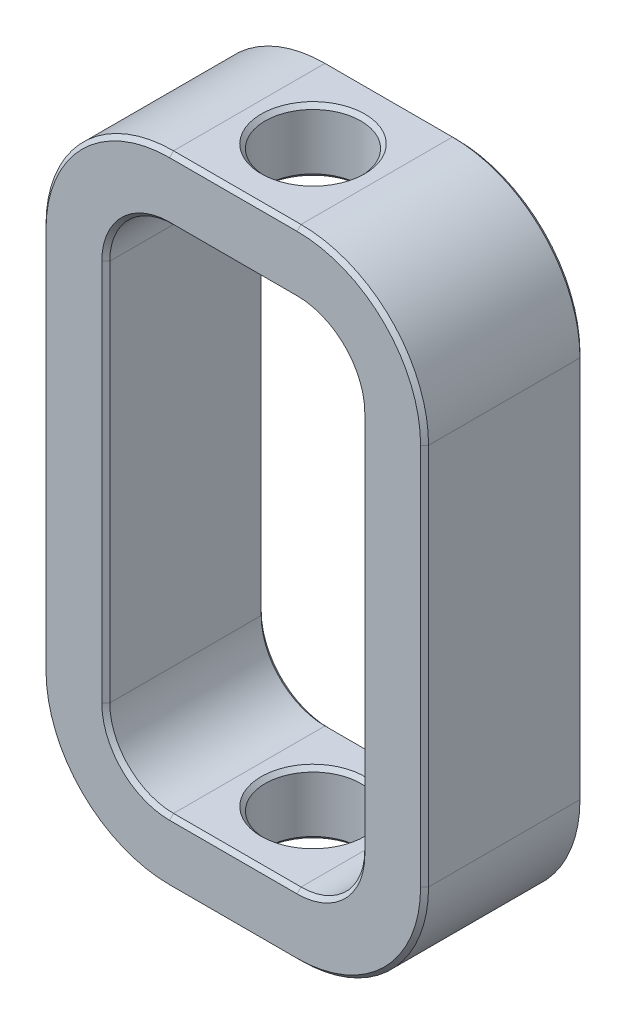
ISO-10303-21;
HEADER;
FILE_DESCRIPTION(('STEP AP214'),'2;1');
FILE_NAME('part.step','',(''),(''),'','','');
FILE_SCHEMA(('AUTOMOTIVE_DESIGN { 1 0 10303 214 1 1 1 1 }'));
ENDSEC;
DATA;
#1=APPLICATION_CONTEXT('core data for automotive mechanical design processes');
#2=APPLICATION_PROTOCOL_DEFINITION('international standard','automotive_design',2000,#1);
#3=PRODUCT_CONTEXT('',#1,'mechanical');
#4=PRODUCT('Part','Part','',(#3));
#5=PRODUCT_RELATED_PRODUCT_CATEGORY('part','',(#4));
#6=PRODUCT_DEFINITION_FORMATION('','',#4);
#7=PRODUCT_DEFINITION_CONTEXT('part definition',#1,'design');
#8=PRODUCT_DEFINITION('design','',#6,#7);
#9=PRODUCT_DEFINITION_SHAPE('','',#8);
#10=(LENGTH_UNIT() NAMED_UNIT(*) SI_UNIT(.MILLI.,.METRE.));
#11=(NAMED_UNIT(*) PLANE_ANGLE_UNIT() SI_UNIT($,.RADIAN.));
#12=(NAMED_UNIT(*) SI_UNIT($,.STERADIAN.) SOLID_ANGLE_UNIT());
#13=UNCERTAINTY_MEASURE_WITH_UNIT(LENGTH_MEASURE(1.E-05),#10,'distance_accuracy_value','');
#14=(GEOMETRIC_REPRESENTATION_CONTEXT(3) GLOBAL_UNCERTAINTY_ASSIGNED_CONTEXT((#13)) GLOBAL_UNIT_ASSIGNED_CONTEXT((#10,
#11,#12)) REPRESENTATION_CONTEXT('',''));
#15=CARTESIAN_POINT('',(0.,0.,0.));
#16=DIRECTION('',(0.,0.,1.));
#17=DIRECTION('',(1.,0.,0.));
#18=AXIS2_PLACEMENT_3D('',#15,#16,#17);
#19=CARTESIAN_POINT('',(-4.,-12.,10.));
#20=DIRECTION('',(0.,0.,-1.));
#21=DIRECTION('',(-1.,0.,0.));
#22=AXIS2_PLACEMENT_3D('',#19,#20,#21);
#23=PLANE('',#22);
#24=CARTESIAN_POINT('',(-4.,-12.,10.));
#25=DIRECTION('',(0.,0.,-1.));
#26=DIRECTION('',(-1.,0.,0.));
#27=AXIS2_PLACEMENT_3D('',#24,#25,#26);
#28=CIRCLE('',#27,4.25000000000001);
#29=CARTESIAN_POINT('',(-3.99999999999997,-16.25,10.));
#30=VERTEX_POINT('',#29);
#31=CARTESIAN_POINT('',(-8.25000000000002,-11.9999999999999,10.));
#32=VERTEX_POINT('',#31);
#33=EDGE_CURVE('E39',#30,#32,#28,.T.);
#34=ORIENTED_EDGE('',*,*,#33,.T.);
#35=DIRECTION('',(0.,1.,0.));
#36=VECTOR('',#35,1.);
#37=CARTESIAN_POINT('',(-8.25000000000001,12.,10.));
#38=LINE('',#37,#36);
#39=CARTESIAN_POINT('',(-8.25000000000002,12.,10.));
#40=VERTEX_POINT('',#39);
#41=EDGE_CURVE('E11',#32,#40,#38,.T.);
#42=ORIENTED_EDGE('',*,*,#41,.T.);
#43=CARTESIAN_POINT('',(-4.,12.,10.));
#44=DIRECTION('',(0.,0.,-1.));
#45=DIRECTION('',(-1.,0.,0.));
#46=AXIS2_PLACEMENT_3D('',#43,#44,#45);
#47=CIRCLE('',#46,4.25000000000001);
#48=CARTESIAN_POINT('',(-3.99999999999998,16.25,10.));
#49=VERTEX_POINT('',#48);
#50=EDGE_CURVE('E395',#40,#49,#47,.T.);
#51=ORIENTED_EDGE('',*,*,#50,.T.);
#52=DIRECTION('',(1.,0.,0.));
#53=VECTOR('',#52,1.);
#54=CARTESIAN_POINT('',(3.99999999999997,16.25,10.));
#55=LINE('',#54,#53);
#56=CARTESIAN_POINT('',(3.99999999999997,16.25,10.));
#57=VERTEX_POINT('',#56);
#58=EDGE_CURVE('E397',#49,#57,#55,.T.);
#59=ORIENTED_EDGE('',*,*,#58,.T.);
#60=CARTESIAN_POINT('',(4.,12.,10.));
#61=DIRECTION('',(0.,0.,-1.));
#62=DIRECTION('',(-1.,0.,0.));
#63=AXIS2_PLACEMENT_3D('',#60,#61,#62);
#64=CIRCLE('',#63,4.25000000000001);
#65=CARTESIAN_POINT('',(8.25000000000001,12.,10.));
#66=VERTEX_POINT('',#65);
#67=EDGE_CURVE('E399',#57,#66,#64,.T.);
#68=ORIENTED_EDGE('',*,*,#67,.T.);
#69=DIRECTION('',(0.,-1.,0.));
#70=VECTOR('',#69,1.);
#71=CARTESIAN_POINT('',(8.25000000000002,-12.,10.));
#72=LINE('',#71,#70);
#73=CARTESIAN_POINT('',(8.25000000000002,-12.,10.));
#74=VERTEX_POINT('',#73);
#75=EDGE_CURVE('E401',#66,#74,#72,.T.);
#76=ORIENTED_EDGE('',*,*,#75,.T.);
#77=CARTESIAN_POINT('',(4.,-12.,10.));
#78=DIRECTION('',(0.,0.,-1.));
#79=DIRECTION('',(-1.,0.,0.));
#80=AXIS2_PLACEMENT_3D('',#77,#78,#79);
#81=CIRCLE('',#80,4.25000000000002);
#82=CARTESIAN_POINT('',(3.99999999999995,-16.25,10.));
#83=VERTEX_POINT('',#82);
#84=EDGE_CURVE('E403',#74,#83,#81,.T.);
#85=ORIENTED_EDGE('',*,*,#84,.T.);
#86=DIRECTION('',(-1.,0.,0.));
#87=VECTOR('',#86,1.);
#88=CARTESIAN_POINT('',(-3.99999999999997,-16.25,10.));
#89=LINE('',#88,#87);
#90=EDGE_CURVE('E50',#83,#30,#89,.T.);
#91=ORIENTED_EDGE('',*,*,#90,.T.);
#92=EDGE_LOOP('',(#34,#42,#51,#59,#68,#76,#85,#91));
#93=FACE_BOUND('',#92,.T.);
#94=CARTESIAN_POINT('',(-4.,12.,10.));
#95=DIRECTION('',(0.,0.,-1.));
#96=DIRECTION('',(-1.,0.,0.));
#97=AXIS2_PLACEMENT_3D('',#94,#95,#96);
#98=CIRCLE('',#97,7.75000000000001);
#99=CARTESIAN_POINT('',(-3.99999999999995,19.75,10.));
#100=VERTEX_POINT('',#99);
#101=CARTESIAN_POINT('',(-11.75,12.,10.));
#102=VERTEX_POINT('',#101);
#103=EDGE_CURVE('E390',#100,#102,#98,.F.);
#104=ORIENTED_EDGE('',*,*,#103,.T.);
#105=DIRECTION('',(0.,-1.,0.));
#106=VECTOR('',#105,1.);
#107=CARTESIAN_POINT('',(-11.75,-12.,10.));
#108=LINE('',#107,#106);
#109=CARTESIAN_POINT('',(-11.75,-11.9999999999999,10.));
#110=VERTEX_POINT('',#109);
#111=EDGE_CURVE('E392',#102,#110,#108,.T.);
#112=ORIENTED_EDGE('',*,*,#111,.T.);
#113=CARTESIAN_POINT('',(-4.,-12.,10.));
#114=DIRECTION('',(0.,0.,-1.));
#115=DIRECTION('',(-1.,0.,0.));
#116=AXIS2_PLACEMENT_3D('',#113,#114,#115);
#117=CIRCLE('',#116,7.75000000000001);
#118=CARTESIAN_POINT('',(-3.99999999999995,-19.75,10.));
#119=VERTEX_POINT('',#118);
#120=EDGE_CURVE('E378',#110,#119,#117,.F.);
#121=ORIENTED_EDGE('',*,*,#120,.T.);
#122=DIRECTION('',(1.,0.,0.));
#123=VECTOR('',#122,1.);
#124=CARTESIAN_POINT('',(-4.,-19.75,10.));
#125=LINE('',#124,#123);
#126=CARTESIAN_POINT('',(3.99999999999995,-19.75,10.));
#127=VERTEX_POINT('',#126);
#128=EDGE_CURVE('E380',#119,#127,#125,.T.);
#129=ORIENTED_EDGE('',*,*,#128,.T.);
#130=CARTESIAN_POINT('',(4.,-12.,10.));
#131=DIRECTION('',(0.,0.,-1.));
#132=DIRECTION('',(-1.,0.,0.));
#133=AXIS2_PLACEMENT_3D('',#130,#131,#132);
#134=CIRCLE('',#133,7.75000000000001);
#135=CARTESIAN_POINT('',(11.75,-11.9999999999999,10.));
#136=VERTEX_POINT('',#135);
#137=EDGE_CURVE('E382',#127,#136,#134,.F.);
#138=ORIENTED_EDGE('',*,*,#137,.T.);
#139=DIRECTION('',(0.,1.,0.));
#140=VECTOR('',#139,1.);
#141=CARTESIAN_POINT('',(11.75,-12.,10.));
#142=LINE('',#141,#140);
#143=CARTESIAN_POINT('',(11.75,12.,10.));
#144=VERTEX_POINT('',#143);
#145=EDGE_CURVE('E384',#136,#144,#142,.T.);
#146=ORIENTED_EDGE('',*,*,#145,.T.);
#147=CARTESIAN_POINT('',(4.,12.,10.));
#148=DIRECTION('',(0.,0.,-1.));
#149=DIRECTION('',(-1.,0.,0.));
#150=AXIS2_PLACEMENT_3D('',#147,#148,#149);
#151=CIRCLE('',#150,7.75000000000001);
#152=CARTESIAN_POINT('',(3.99999999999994,19.75,10.));
#153=VERTEX_POINT('',#152);
#154=EDGE_CURVE('E386',#144,#153,#151,.F.);
#155=ORIENTED_EDGE('',*,*,#154,.T.);
#156=DIRECTION('',(-1.,0.,0.));
#157=VECTOR('',#156,1.);
#158=CARTESIAN_POINT('',(-4.,19.75,10.));
#159=LINE('',#158,#157);
#160=EDGE_CURVE('E388',#153,#100,#159,.T.);
#161=ORIENTED_EDGE('',*,*,#160,.T.);
#162=EDGE_LOOP('',(#104,#112,#121,#129,#138,#146,#155,#161));
#163=FACE_BOUND('',#162,.T.);
#164=ADVANCED_FACE('F30',(#93,#163),#23,.F.);
#165=CARTESIAN_POINT('',(-4.,-12.,0.));
#166=DIRECTION('',(0.,0.,-1.));
#167=DIRECTION('',(-1.,0.,0.));
#168=AXIS2_PLACEMENT_3D('',#165,#166,#167);
#169=PLANE('',#168);
#170=DIRECTION('',(0.,1.,0.));
#171=VECTOR('',#170,1.);
#172=CARTESIAN_POINT('',(8.25,-12.,0.));
#173=LINE('',#172,#171);
#174=CARTESIAN_POINT('',(8.25000000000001,-12.,0.));
#175=VERTEX_POINT('',#174);
#176=CARTESIAN_POINT('',(8.25,12.,0.));
#177=VERTEX_POINT('',#176);
#178=EDGE_CURVE('E283',#175,#177,#173,.T.);
#179=ORIENTED_EDGE('',*,*,#178,.T.);
#180=CARTESIAN_POINT('',(4.,12.,0.));
#181=DIRECTION('',(0.,0.,-1.));
#182=DIRECTION('',(-1.,0.,0.));
#183=AXIS2_PLACEMENT_3D('',#180,#181,#182);
#184=CIRCLE('',#183,4.25);
#185=CARTESIAN_POINT('',(3.99999999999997,16.25,0.));
#186=VERTEX_POINT('',#185);
#187=EDGE_CURVE('E285',#177,#186,#184,.F.);
#188=ORIENTED_EDGE('',*,*,#187,.T.);
#189=DIRECTION('',(-1.,0.,0.));
#190=VECTOR('',#189,1.);
#191=CARTESIAN_POINT('',(-4.,16.25,0.));
#192=LINE('',#191,#190);
#193=CARTESIAN_POINT('',(-3.99999999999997,16.25,0.));
#194=VERTEX_POINT('',#193);
#195=EDGE_CURVE('E266',#186,#194,#192,.T.);
#196=ORIENTED_EDGE('',*,*,#195,.T.);
#197=CARTESIAN_POINT('',(-4.,12.,0.));
#198=DIRECTION('',(0.,0.,-1.));
#199=DIRECTION('',(-1.,0.,0.));
#200=AXIS2_PLACEMENT_3D('',#197,#198,#199);
#201=CIRCLE('',#200,4.25);
#202=CARTESIAN_POINT('',(-8.25,12.,0.));
#203=VERTEX_POINT('',#202);
#204=EDGE_CURVE('E268',#194,#203,#201,.F.);
#205=ORIENTED_EDGE('',*,*,#204,.T.);
#206=DIRECTION('',(0.,-1.,0.));
#207=VECTOR('',#206,1.);
#208=CARTESIAN_POINT('',(-8.25,-12.,0.));
#209=LINE('',#208,#207);
#210=CARTESIAN_POINT('',(-8.25,-11.9999999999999,0.));
#211=VERTEX_POINT('',#210);
#212=EDGE_CURVE('E275',#203,#211,#209,.T.);
#213=ORIENTED_EDGE('',*,*,#212,.T.);
#214=CARTESIAN_POINT('',(-4.,-12.,0.));
#215=DIRECTION('',(0.,0.,-1.));
#216=DIRECTION('',(-1.,0.,0.));
#217=AXIS2_PLACEMENT_3D('',#214,#215,#216);
#218=CIRCLE('',#217,4.25);
#219=CARTESIAN_POINT('',(-3.99999999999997,-16.25,0.));
#220=VERTEX_POINT('',#219);
#221=EDGE_CURVE('E277',#211,#220,#218,.F.);
#222=ORIENTED_EDGE('',*,*,#221,.T.);
#223=DIRECTION('',(1.,0.,0.));
#224=VECTOR('',#223,1.);
#225=CARTESIAN_POINT('',(-4.,-16.25,0.));
#226=LINE('',#225,#224);
#227=CARTESIAN_POINT('',(3.99999999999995,-16.25,0.));
#228=VERTEX_POINT('',#227);
#229=EDGE_CURVE('E279',#220,#228,#226,.T.);
#230=ORIENTED_EDGE('',*,*,#229,.T.);
#231=CARTESIAN_POINT('',(4.,-12.,0.));
#232=DIRECTION('',(0.,0.,-1.));
#233=DIRECTION('',(-1.,0.,0.));
#234=AXIS2_PLACEMENT_3D('',#231,#232,#233);
#235=CIRCLE('',#234,4.25);
#236=EDGE_CURVE('E281',#228,#175,#235,.F.);
#237=ORIENTED_EDGE('',*,*,#236,.T.);
#238=EDGE_LOOP('',(#179,#188,#196,#205,#213,#222,#230,#237));
#239=FACE_BOUND('',#238,.T.);
#240=CARTESIAN_POINT('',(4.,-12.,0.));
#241=DIRECTION('',(0.,0.,-1.));
#242=DIRECTION('',(-1.,0.,0.));
#243=AXIS2_PLACEMENT_3D('',#240,#241,#242);
#244=CIRCLE('',#243,7.75000000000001);
#245=CARTESIAN_POINT('',(11.75,-11.9999999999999,0.));
#246=VERTEX_POINT('',#245);
#247=CARTESIAN_POINT('',(3.99999999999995,-19.75,0.));
#248=VERTEX_POINT('',#247);
#249=EDGE_CURVE('E265',#246,#248,#244,.T.);
#250=ORIENTED_EDGE('',*,*,#249,.T.);
#251=DIRECTION('',(-1.,0.,0.));
#252=VECTOR('',#251,1.);
#253=CARTESIAN_POINT('',(-3.99999999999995,-19.75,0.));
#254=LINE('',#253,#252);
#255=CARTESIAN_POINT('',(-3.99999999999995,-19.75,0.));
#256=VERTEX_POINT('',#255);
#257=EDGE_CURVE('E244',#248,#256,#254,.T.);
#258=ORIENTED_EDGE('',*,*,#257,.T.);
#259=CARTESIAN_POINT('',(-4.,-12.,0.));
#260=DIRECTION('',(0.,0.,-1.));
#261=DIRECTION('',(-1.,0.,0.));
#262=AXIS2_PLACEMENT_3D('',#259,#260,#261);
#263=CIRCLE('',#262,7.75000000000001);
#264=CARTESIAN_POINT('',(-11.75,-11.9999999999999,0.));
#265=VERTEX_POINT('',#264);
#266=EDGE_CURVE('E254',#256,#265,#263,.T.);
#267=ORIENTED_EDGE('',*,*,#266,.T.);
#268=DIRECTION('',(0.,1.,0.));
#269=VECTOR('',#268,1.);
#270=CARTESIAN_POINT('',(-11.75,12.,0.));
#271=LINE('',#270,#269);
#272=CARTESIAN_POINT('',(-11.75,12.,0.));
#273=VERTEX_POINT('',#272);
#274=EDGE_CURVE('E260',#265,#273,#271,.T.);
#275=ORIENTED_EDGE('',*,*,#274,.T.);
#276=CARTESIAN_POINT('',(-4.,12.,0.));
#277=DIRECTION('',(0.,0.,-1.));
#278=DIRECTION('',(-1.,0.,0.));
#279=AXIS2_PLACEMENT_3D('',#276,#277,#278);
#280=CIRCLE('',#279,7.75000000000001);
#281=CARTESIAN_POINT('',(-3.99999999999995,19.75,0.));
#282=VERTEX_POINT('',#281);
#283=EDGE_CURVE('E523',#273,#282,#280,.T.);
#284=ORIENTED_EDGE('',*,*,#283,.T.);
#285=DIRECTION('',(1.,0.,0.));
#286=VECTOR('',#285,1.);
#287=CARTESIAN_POINT('',(3.99999999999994,19.75,0.));
#288=LINE('',#287,#286);
#289=CARTESIAN_POINT('',(3.99999999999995,19.75,0.));
#290=VERTEX_POINT('',#289);
#291=EDGE_CURVE('E525',#282,#290,#288,.T.);
#292=ORIENTED_EDGE('',*,*,#291,.T.);
#293=CARTESIAN_POINT('',(4.,12.,0.));
#294=DIRECTION('',(0.,0.,-1.));
#295=DIRECTION('',(-1.,0.,0.));
#296=AXIS2_PLACEMENT_3D('',#293,#294,#295);
#297=CIRCLE('',#296,7.75000000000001);
#298=CARTESIAN_POINT('',(11.75,12.,0.));
#299=VERTEX_POINT('',#298);
#300=EDGE_CURVE('E527',#290,#299,#297,.T.);
#301=ORIENTED_EDGE('',*,*,#300,.T.);
#302=DIRECTION('',(0.,-1.,0.));
#303=VECTOR('',#302,1.);
#304=CARTESIAN_POINT('',(11.75,-11.9999999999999,0.));
#305=LINE('',#304,#303);
#306=EDGE_CURVE('E270',#299,#246,#305,.T.);
#307=ORIENTED_EDGE('',*,*,#306,.T.);
#308=EDGE_LOOP('',(#250,#258,#267,#275,#284,#292,#301,#307));
#309=FACE_BOUND('',#308,.T.);
#310=ADVANCED_FACE('F263',(#239,#309),#169,.T.);
#311=CARTESIAN_POINT('',(-4.,-12.,10.));
#312=DIRECTION('',(0.,0.,-1.));
#313=DIRECTION('',(-1.,0.,0.));
#314=AXIS2_PLACEMENT_3D('',#311,#312,#313);
#315=CYLINDRICAL_SURFACE('',#314,8.);
#316=DIRECTION('',(0.,0.,-1.));
#317=VECTOR('',#316,1.);
#318=CARTESIAN_POINT('',(-12.,-11.9999999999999,10.));
#319=LINE('',#318,#317);
#320=CARTESIAN_POINT('',(-12.,-11.9999999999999,9.75000000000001));
#321=VERTEX_POINT('',#320);
#322=CARTESIAN_POINT('',(-12.,-11.9999999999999,0.249999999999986));
#323=VERTEX_POINT('',#322);
#324=EDGE_CURVE('E566',#321,#323,#319,.T.);
#325=ORIENTED_EDGE('',*,*,#324,.T.);
#326=CARTESIAN_POINT('',(-4.,-12.,0.249999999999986));
#327=DIRECTION('',(0.,0.,-1.));
#328=DIRECTION('',(-1.,0.,0.));
#329=AXIS2_PLACEMENT_3D('',#326,#327,#328);
#330=CIRCLE('',#329,8.);
#331=CARTESIAN_POINT('',(-3.99999999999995,-20.,0.249999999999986));
#332=VERTEX_POINT('',#331);
#333=EDGE_CURVE('E364',#323,#332,#330,.F.);
#334=ORIENTED_EDGE('',*,*,#333,.T.);
#335=DIRECTION('',(0.,0.,-1.));
#336=VECTOR('',#335,1.);
#337=CARTESIAN_POINT('',(-3.99999999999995,-20.,10.));
#338=LINE('',#337,#336);
#339=CARTESIAN_POINT('',(-3.99999999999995,-20.,9.75000000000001));
#340=VERTEX_POINT('',#339);
#341=EDGE_CURVE('E261',#340,#332,#338,.T.);
#342=ORIENTED_EDGE('',*,*,#341,.F.);
#343=CARTESIAN_POINT('',(-4.,-12.,9.75000000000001));
#344=DIRECTION('',(0.,0.,-1.));
#345=DIRECTION('',(-1.,0.,0.));
#346=AXIS2_PLACEMENT_3D('',#343,#344,#345);
#347=CIRCLE('',#346,8.);
#348=EDGE_CURVE('E362',#340,#321,#347,.T.);
#349=ORIENTED_EDGE('',*,*,#348,.T.);
#350=EDGE_LOOP('',(#325,#334,#342,#349));
#351=FACE_BOUND('',#350,.T.);
#352=ADVANCED_FACE('F544',(#351),#315,.T.);
#353=CARTESIAN_POINT('',(3.99999999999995,-20.,10.));
#354=DIRECTION('',(0.,1.,0.));
#355=DIRECTION('',(0.,0.,1.));
#356=AXIS2_PLACEMENT_3D('',#353,#354,#355);
#357=PLANE('',#356);
#358=CARTESIAN_POINT('',(0.,-20.,5.));
#359=DIRECTION('',(0.,1.,0.));
#360=DIRECTION('',(0.,0.,1.));
#361=AXIS2_PLACEMENT_3D('',#358,#359,#360);
#362=CIRCLE('',#361,3.25000000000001);
#363=CARTESIAN_POINT('',(0.,-20.,8.25000000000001));
#364=VERTEX_POINT('',#363);
#365=EDGE_CURVE('E330',#364,#364,#362,.T.);
#366=ORIENTED_EDGE('',*,*,#365,.T.);
#367=EDGE_LOOP('',(#366));
#368=FACE_BOUND('',#367,.T.);
#369=ORIENTED_EDGE('',*,*,#341,.T.);
#370=DIRECTION('',(1.,0.,0.));
#371=VECTOR('',#370,1.);
#372=CARTESIAN_POINT('',(3.99999999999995,-20.,0.249999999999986));
#373=LINE('',#372,#371);
#374=CARTESIAN_POINT('',(3.99999999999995,-20.,0.249999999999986));
#375=VERTEX_POINT('',#374);
#376=EDGE_CURVE('E247',#332,#375,#373,.T.);
#377=ORIENTED_EDGE('',*,*,#376,.T.);
#378=DIRECTION('',(0.,0.,-1.));
#379=VECTOR('',#378,1.);
#380=CARTESIAN_POINT('',(3.99999999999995,-20.,10.));
#381=LINE('',#380,#379);
#382=CARTESIAN_POINT('',(3.99999999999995,-20.,9.75000000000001));
#383=VERTEX_POINT('',#382);
#384=EDGE_CURVE('E513',#383,#375,#381,.T.);
#385=ORIENTED_EDGE('',*,*,#384,.F.);
#386=DIRECTION('',(-1.,0.,0.));
#387=VECTOR('',#386,1.);
#388=CARTESIAN_POINT('',(3.99999999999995,-20.,9.75000000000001));
#389=LINE('',#388,#387);
#390=EDGE_CURVE('E328',#383,#340,#389,.T.);
#391=ORIENTED_EDGE('',*,*,#390,.T.);
#392=EDGE_LOOP('',(#369,#377,#385,#391));
#393=FACE_BOUND('',#392,.T.);
#394=ADVANCED_FACE('F537',(#368,#393),#357,.F.);
#395=CARTESIAN_POINT('',(4.,-12.,10.));
#396=DIRECTION('',(0.,0.,-1.));
#397=DIRECTION('',(-1.,0.,0.));
#398=AXIS2_PLACEMENT_3D('',#395,#396,#397);
#399=CYLINDRICAL_SURFACE('',#398,8.);
#400=ORIENTED_EDGE('',*,*,#384,.T.);
#401=CARTESIAN_POINT('',(4.,-12.,0.249999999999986));
#402=DIRECTION('',(0.,0.,-1.));
#403=DIRECTION('',(-1.,0.,0.));
#404=AXIS2_PLACEMENT_3D('',#401,#402,#403);
#405=CIRCLE('',#404,8.);
#406=CARTESIAN_POINT('',(12.,-11.9999999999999,0.249999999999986));
#407=VERTEX_POINT('',#406);
#408=EDGE_CURVE('E336',#375,#407,#405,.F.);
#409=ORIENTED_EDGE('',*,*,#408,.T.);
#410=DIRECTION('',(0.,0.,-1.));
#411=VECTOR('',#410,1.);
#412=CARTESIAN_POINT('',(12.,-11.9999999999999,10.));
#413=LINE('',#412,#411);
#414=CARTESIAN_POINT('',(12.,-11.9999999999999,9.75000000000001));
#415=VERTEX_POINT('',#414);
#416=EDGE_CURVE('E504',#415,#407,#413,.T.);
#417=ORIENTED_EDGE('',*,*,#416,.F.);
#418=CARTESIAN_POINT('',(4.,-12.,9.75000000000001));
#419=DIRECTION('',(0.,0.,-1.));
#420=DIRECTION('',(-1.,0.,0.));
#421=AXIS2_PLACEMENT_3D('',#418,#419,#420);
#422=CIRCLE('',#421,8.);
#423=EDGE_CURVE('E334',#415,#383,#422,.T.);
#424=ORIENTED_EDGE('',*,*,#423,.T.);
#425=EDGE_LOOP('',(#400,#409,#417,#424));
#426=FACE_BOUND('',#425,.T.);
#427=ADVANCED_FACE('F510',(#426),#399,.T.);
#428=CARTESIAN_POINT('',(12.,12.,10.));
#429=DIRECTION('',(-1.,0.,0.));
#430=DIRECTION('',(0.,-1.,0.));
#431=AXIS2_PLACEMENT_3D('',#428,#429,#430);
#432=PLANE('',#431);
#433=ORIENTED_EDGE('',*,*,#416,.T.);
#434=DIRECTION('',(0.,1.,0.));
#435=VECTOR('',#434,1.);
#436=CARTESIAN_POINT('',(12.,12.,0.249999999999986));
#437=LINE('',#436,#435);
#438=CARTESIAN_POINT('',(12.,12.,0.249999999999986));
#439=VERTEX_POINT('',#438);
#440=EDGE_CURVE('E340',#407,#439,#437,.T.);
#441=ORIENTED_EDGE('',*,*,#440,.T.);
#442=DIRECTION('',(0.,0.,-1.));
#443=VECTOR('',#442,1.);
#444=CARTESIAN_POINT('',(12.,12.,10.));
#445=LINE('',#444,#443);
#446=CARTESIAN_POINT('',(12.,12.,9.75000000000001));
#447=VERTEX_POINT('',#446);
#448=EDGE_CURVE('E507',#447,#439,#445,.T.);
#449=ORIENTED_EDGE('',*,*,#448,.F.);
#450=DIRECTION('',(0.,-1.,0.));
#451=VECTOR('',#450,1.);
#452=CARTESIAN_POINT('',(12.,12.,9.75000000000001));
#453=LINE('',#452,#451);
#454=EDGE_CURVE('E338',#447,#415,#453,.T.);
#455=ORIENTED_EDGE('',*,*,#454,.T.);
#456=EDGE_LOOP('',(#433,#441,#449,#455));
#457=FACE_BOUND('',#456,.T.);
#458=ADVANCED_FACE('F503',(#457),#432,.F.);
#459=CARTESIAN_POINT('',(4.,12.,10.));
#460=DIRECTION('',(0.,0.,-1.));
#461=DIRECTION('',(-1.,0.,0.));
#462=AXIS2_PLACEMENT_3D('',#459,#460,#461);
#463=CYLINDRICAL_SURFACE('',#462,8.);
#464=ORIENTED_EDGE('',*,*,#448,.T.);
#465=CARTESIAN_POINT('',(4.,12.,0.249999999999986));
#466=DIRECTION('',(0.,0.,-1.));
#467=DIRECTION('',(-1.,0.,0.));
#468=AXIS2_PLACEMENT_3D('',#465,#466,#467);
#469=CIRCLE('',#468,8.);
#470=CARTESIAN_POINT('',(3.99999999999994,20.,0.249999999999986));
#471=VERTEX_POINT('',#470);
#472=EDGE_CURVE('E344',#439,#471,#469,.F.);
#473=ORIENTED_EDGE('',*,*,#472,.T.);
#474=DIRECTION('',(0.,0.,-1.));
#475=VECTOR('',#474,1.);
#476=CARTESIAN_POINT('',(3.99999999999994,20.,10.));
#477=LINE('',#476,#475);
#478=CARTESIAN_POINT('',(3.99999999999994,20.,9.75000000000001));
#479=VERTEX_POINT('',#478);
#480=EDGE_CURVE('E516',#479,#471,#477,.T.);
#481=ORIENTED_EDGE('',*,*,#480,.F.);
#482=CARTESIAN_POINT('',(4.,12.,9.75000000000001));
#483=DIRECTION('',(0.,0.,-1.));
#484=DIRECTION('',(-1.,0.,0.));
#485=AXIS2_PLACEMENT_3D('',#482,#483,#484);
#486=CIRCLE('',#485,8.);
#487=EDGE_CURVE('E342',#479,#447,#486,.T.);
#488=ORIENTED_EDGE('',*,*,#487,.T.);
#489=EDGE_LOOP('',(#464,#473,#481,#488));
#490=FACE_BOUND('',#489,.T.);
#491=ADVANCED_FACE('F593',(#490),#463,.T.);
#492=CARTESIAN_POINT('',(3.99999999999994,20.,10.));
#493=DIRECTION('',(0.,-1.,0.));
#494=DIRECTION('',(0.,0.,-1.));
#495=AXIS2_PLACEMENT_3D('',#492,#493,#494);
#496=PLANE('',#495);
#497=CARTESIAN_POINT('',(0.,20.,5.));
#498=DIRECTION('',(0.,-1.,0.));
#499=DIRECTION('',(0.,0.,-1.));
#500=AXIS2_PLACEMENT_3D('',#497,#498,#499);
#501=CIRCLE('',#500,3.25);
#502=CARTESIAN_POINT('',(0.,20.,1.75));
#503=VERTEX_POINT('',#502);
#504=EDGE_CURVE('E348',#503,#503,#501,.T.);
#505=ORIENTED_EDGE('',*,*,#504,.T.);
#506=EDGE_LOOP('',(#505));
#507=FACE_BOUND('',#506,.T.);
#508=ORIENTED_EDGE('',*,*,#480,.T.);
#509=DIRECTION('',(-1.,0.,0.));
#510=VECTOR('',#509,1.);
#511=CARTESIAN_POINT('',(-3.99999999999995,20.,0.249999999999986));
#512=LINE('',#511,#510);
#513=CARTESIAN_POINT('',(-3.99999999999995,20.,0.249999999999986));
#514=VERTEX_POINT('',#513);
#515=EDGE_CURVE('E351',#471,#514,#512,.T.);
#516=ORIENTED_EDGE('',*,*,#515,.T.);
#517=DIRECTION('',(0.,0.,-1.));
#518=VECTOR('',#517,1.);
#519=CARTESIAN_POINT('',(-3.99999999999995,20.,10.));
#520=LINE('',#519,#518);
#521=CARTESIAN_POINT('',(-3.99999999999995,20.,9.75000000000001));
#522=VERTEX_POINT('',#521);
#523=EDGE_CURVE('E572',#522,#514,#520,.T.);
#524=ORIENTED_EDGE('',*,*,#523,.F.);
#525=DIRECTION('',(1.,0.,0.));
#526=VECTOR('',#525,1.);
#527=CARTESIAN_POINT('',(3.99999999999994,20.,9.75000000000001));
#528=LINE('',#527,#526);
#529=EDGE_CURVE('E346',#522,#479,#528,.T.);
#530=ORIENTED_EDGE('',*,*,#529,.T.);
#531=EDGE_LOOP('',(#508,#516,#524,#530));
#532=FACE_BOUND('',#531,.T.);
#533=ADVANCED_FACE('F582',(#507,#532),#496,.F.);
#534=CARTESIAN_POINT('',(-4.,12.,10.));
#535=DIRECTION('',(0.,0.,-1.));
#536=DIRECTION('',(-1.,0.,0.));
#537=AXIS2_PLACEMENT_3D('',#534,#535,#536);
#538=CYLINDRICAL_SURFACE('',#537,8.);
#539=ORIENTED_EDGE('',*,*,#523,.T.);
#540=CARTESIAN_POINT('',(-4.,12.,0.249999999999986));
#541=DIRECTION('',(0.,0.,-1.));
#542=DIRECTION('',(-1.,0.,0.));
#543=AXIS2_PLACEMENT_3D('',#540,#541,#542);
#544=CIRCLE('',#543,8.);
#545=CARTESIAN_POINT('',(-12.,12.,0.249999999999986));
#546=VERTEX_POINT('',#545);
#547=EDGE_CURVE('E355',#514,#546,#544,.F.);
#548=ORIENTED_EDGE('',*,*,#547,.T.);
#549=DIRECTION('',(0.,0.,-1.));
#550=VECTOR('',#549,1.);
#551=CARTESIAN_POINT('',(-12.,12.,10.));
#552=LINE('',#551,#550);
#553=CARTESIAN_POINT('',(-12.,12.,9.75000000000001));
#554=VERTEX_POINT('',#553);
#555=EDGE_CURVE('E564',#554,#546,#552,.T.);
#556=ORIENTED_EDGE('',*,*,#555,.F.);
#557=CARTESIAN_POINT('',(-4.,12.,9.75000000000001));
#558=DIRECTION('',(0.,0.,-1.));
#559=DIRECTION('',(-1.,0.,0.));
#560=AXIS2_PLACEMENT_3D('',#557,#558,#559);
#561=CIRCLE('',#560,8.);
#562=EDGE_CURVE('E353',#554,#522,#561,.T.);
#563=ORIENTED_EDGE('',*,*,#562,.T.);
#564=EDGE_LOOP('',(#539,#548,#556,#563));
#565=FACE_BOUND('',#564,.T.);
#566=ADVANCED_FACE('F569',(#565),#538,.T.);
#567=CARTESIAN_POINT('',(-12.,12.,10.));
#568=DIRECTION('',(1.,0.,0.));
#569=DIRECTION('',(0.,1.,0.));
#570=AXIS2_PLACEMENT_3D('',#567,#568,#569);
#571=PLANE('',#570);
#572=ORIENTED_EDGE('',*,*,#555,.T.);
#573=DIRECTION('',(0.,-1.,0.));
#574=VECTOR('',#573,1.);
#575=CARTESIAN_POINT('',(-12.,-11.9999999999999,0.249999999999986));
#576=LINE('',#575,#574);
#577=EDGE_CURVE('E360',#546,#323,#576,.T.);
#578=ORIENTED_EDGE('',*,*,#577,.T.);
#579=ORIENTED_EDGE('',*,*,#324,.F.);
#580=DIRECTION('',(0.,1.,0.));
#581=VECTOR('',#580,1.);
#582=CARTESIAN_POINT('',(-12.,12.,9.75000000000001));
#583=LINE('',#582,#581);
#584=EDGE_CURVE('E357',#321,#554,#583,.T.);
#585=ORIENTED_EDGE('',*,*,#584,.T.);
#586=EDGE_LOOP('',(#572,#578,#579,#585));
#587=FACE_BOUND('',#586,.T.);
#588=ADVANCED_FACE('F563',(#587),#571,.F.);
#589=CARTESIAN_POINT('',(-4.,12.,10.));
#590=DIRECTION('',(0.,0.,-1.));
#591=DIRECTION('',(-1.,0.,0.));
#592=AXIS2_PLACEMENT_3D('',#589,#590,#591);
#593=CYLINDRICAL_SURFACE('',#592,4.);
#594=DIRECTION('',(0.,0.,-1.));
#595=VECTOR('',#594,1.);
#596=CARTESIAN_POINT('',(-8.,12.,10.));
#597=LINE('',#596,#595);
#598=CARTESIAN_POINT('',(-8.,12.,9.74999999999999));
#599=VERTEX_POINT('',#598);
#600=CARTESIAN_POINT('',(-8.,12.,0.25));
#601=VERTEX_POINT('',#600);
#602=EDGE_CURVE('E575',#599,#601,#597,.T.);
#603=ORIENTED_EDGE('',*,*,#602,.T.);
#604=CARTESIAN_POINT('',(-4.,12.,0.25));
#605=DIRECTION('',(0.,0.,-1.));
#606=DIRECTION('',(-1.,0.,0.));
#607=AXIS2_PLACEMENT_3D('',#604,#605,#606);
#608=CIRCLE('',#607,4.);
#609=CARTESIAN_POINT('',(-3.99999999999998,16.,0.25));
#610=VERTEX_POINT('',#609);
#611=EDGE_CURVE('E319',#601,#610,#608,.T.);
#612=ORIENTED_EDGE('',*,*,#611,.T.);
#613=DIRECTION('',(0.,0.,-1.));
#614=VECTOR('',#613,1.);
#615=CARTESIAN_POINT('',(-3.99999999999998,16.,10.));
#616=LINE('',#615,#614);
#617=CARTESIAN_POINT('',(-3.99999999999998,16.,9.74999999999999));
#618=VERTEX_POINT('',#617);
#619=EDGE_CURVE('E430',#618,#610,#616,.T.);
#620=ORIENTED_EDGE('',*,*,#619,.F.);
#621=CARTESIAN_POINT('',(-4.,12.,9.74999999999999));
#622=DIRECTION('',(0.,0.,-1.));
#623=DIRECTION('',(-1.,0.,0.));
#624=AXIS2_PLACEMENT_3D('',#621,#622,#623);
#625=CIRCLE('',#624,4.);
#626=EDGE_CURVE('E317',#618,#599,#625,.F.);
#627=ORIENTED_EDGE('',*,*,#626,.T.);
#628=EDGE_LOOP('',(#603,#612,#620,#627));
#629=FACE_BOUND('',#628,.T.);
#630=ADVANCED_FACE('F612',(#629),#593,.F.);
#631=CARTESIAN_POINT('',(-8.,12.,10.));
#632=DIRECTION('',(1.,0.,0.));
#633=DIRECTION('',(0.,0.,-1.));
#634=AXIS2_PLACEMENT_3D('',#631,#632,#633);
#635=PLANE('',#634);
#636=DIRECTION('',(0.,0.,-1.));
#637=VECTOR('',#636,1.);
#638=CARTESIAN_POINT('',(-8.,-11.9999999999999,10.));
#639=LINE('',#638,#637);
#640=CARTESIAN_POINT('',(-8.,-11.9999999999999,9.74999999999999));
#641=VERTEX_POINT('',#640);
#642=CARTESIAN_POINT('',(-8.,-11.9999999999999,0.25));
#643=VERTEX_POINT('',#642);
#644=EDGE_CURVE('E1142',#641,#643,#639,.T.);
#645=ORIENTED_EDGE('',*,*,#644,.T.);
#646=DIRECTION('',(0.,1.,0.));
#647=VECTOR('',#646,1.);
#648=CARTESIAN_POINT('',(-8.,12.,0.25));
#649=LINE('',#648,#647);
#650=EDGE_CURVE('E315',#643,#601,#649,.T.);
#651=ORIENTED_EDGE('',*,*,#650,.T.);
#652=ORIENTED_EDGE('',*,*,#602,.F.);
#653=DIRECTION('',(0.,-1.,0.));
#654=VECTOR('',#653,1.);
#655=CARTESIAN_POINT('',(-8.,-11.9999999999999,9.74999999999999));
#656=LINE('',#655,#654);
#657=EDGE_CURVE('E312',#599,#641,#656,.T.);
#658=ORIENTED_EDGE('',*,*,#657,.T.);
#659=EDGE_LOOP('',(#645,#651,#652,#658));
#660=FACE_BOUND('',#659,.T.);
#661=ADVANCED_FACE('F632',(#660),#635,.T.);
#662=CARTESIAN_POINT('',(-4.,-12.,10.));
#663=DIRECTION('',(0.,0.,-1.));
#664=DIRECTION('',(-1.,0.,0.));
#665=AXIS2_PLACEMENT_3D('',#662,#663,#664);
#666=CYLINDRICAL_SURFACE('',#665,4.);
#667=DIRECTION('',(0.,0.,-1.));
#668=VECTOR('',#667,1.);
#669=CARTESIAN_POINT('',(-3.99999999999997,-16.,10.));
#670=LINE('',#669,#668);
#671=CARTESIAN_POINT('',(-3.99999999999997,-16.,9.74999999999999));
#672=VERTEX_POINT('',#671);
#673=CARTESIAN_POINT('',(-3.99999999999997,-16.,0.25));
#674=VERTEX_POINT('',#673);
#675=EDGE_CURVE('E1146',#672,#674,#670,.T.);
#676=ORIENTED_EDGE('',*,*,#675,.T.);
#677=CARTESIAN_POINT('',(-4.,-12.,0.25));
#678=DIRECTION('',(0.,0.,-1.));
#679=DIRECTION('',(-1.,0.,0.));
#680=AXIS2_PLACEMENT_3D('',#677,#678,#679);
#681=CIRCLE('',#680,4.);
#682=EDGE_CURVE('E310',#674,#643,#681,.T.);
#683=ORIENTED_EDGE('',*,*,#682,.T.);
#684=ORIENTED_EDGE('',*,*,#644,.F.);
#685=CARTESIAN_POINT('',(-4.,-12.,9.74999999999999));
#686=DIRECTION('',(0.,0.,-1.));
#687=DIRECTION('',(-1.,0.,0.));
#688=AXIS2_PLACEMENT_3D('',#685,#686,#687);
#689=CIRCLE('',#688,4.);
#690=EDGE_CURVE('E308',#641,#672,#689,.F.);
#691=ORIENTED_EDGE('',*,*,#690,.T.);
#692=EDGE_LOOP('',(#676,#683,#684,#691));
#693=FACE_BOUND('',#692,.T.);
#694=ADVANCED_FACE('F639',(#693),#666,.F.);
#695=CARTESIAN_POINT('',(3.99999999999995,-16.,10.));
#696=DIRECTION('',(0.,1.,0.));
#697=DIRECTION('',(0.,0.,1.));
#698=AXIS2_PLACEMENT_3D('',#695,#696,#697);
#699=PLANE('',#698);
#700=CARTESIAN_POINT('',(0.,-16.,5.));
#701=DIRECTION('',(0.,1.,0.));
#702=DIRECTION('',(0.,0.,1.));
#703=AXIS2_PLACEMENT_3D('',#700,#701,#702);
#704=CIRCLE('',#703,3.25);
#705=CARTESIAN_POINT('',(0.,-16.,8.25));
#706=VERTEX_POINT('',#705);
#707=EDGE_CURVE('E303',#706,#706,#704,.F.);
#708=ORIENTED_EDGE('',*,*,#707,.T.);
#709=EDGE_LOOP('',(#708));
#710=FACE_BOUND('',#709,.T.);
#711=DIRECTION('',(0.,0.,-1.));
#712=VECTOR('',#711,1.);
#713=CARTESIAN_POINT('',(3.99999999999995,-16.,10.));
#714=LINE('',#713,#712);
#715=CARTESIAN_POINT('',(3.99999999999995,-16.,9.74999999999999));
#716=VERTEX_POINT('',#715);
#717=CARTESIAN_POINT('',(3.99999999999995,-16.,0.25));
#718=VERTEX_POINT('',#717);
#719=EDGE_CURVE('E1148',#716,#718,#714,.T.);
#720=ORIENTED_EDGE('',*,*,#719,.T.);
#721=DIRECTION('',(-1.,0.,0.));
#722=VECTOR('',#721,1.);
#723=CARTESIAN_POINT('',(3.99999999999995,-16.,0.25));
#724=LINE('',#723,#722);
#725=EDGE_CURVE('E306',#718,#674,#724,.T.);
#726=ORIENTED_EDGE('',*,*,#725,.T.);
#727=ORIENTED_EDGE('',*,*,#675,.F.);
#728=DIRECTION('',(1.,0.,0.));
#729=VECTOR('',#728,1.);
#730=CARTESIAN_POINT('',(3.99999999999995,-16.,9.74999999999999));
#731=LINE('',#730,#729);
#732=EDGE_CURVE('E301',#672,#716,#731,.T.);
#733=ORIENTED_EDGE('',*,*,#732,.T.);
#734=EDGE_LOOP('',(#720,#726,#727,#733));
#735=FACE_BOUND('',#734,.T.);
#736=ADVANCED_FACE('F646',(#710,#735),#699,.T.);
#737=CARTESIAN_POINT('',(4.,-12.,10.));
#738=DIRECTION('',(0.,0.,-1.));
#739=DIRECTION('',(-1.,0.,0.));
#740=AXIS2_PLACEMENT_3D('',#737,#738,#739);
#741=CYLINDRICAL_SURFACE('',#740,4.);
#742=DIRECTION('',(0.,0.,-1.));
#743=VECTOR('',#742,1.);
#744=CARTESIAN_POINT('',(8.,-12.,10.));
#745=LINE('',#744,#743);
#746=CARTESIAN_POINT('',(8.,-12.,9.74999999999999));
#747=VERTEX_POINT('',#746);
#748=CARTESIAN_POINT('',(8.,-12.,0.25));
#749=VERTEX_POINT('',#748);
#750=EDGE_CURVE('E1153',#747,#749,#745,.T.);
#751=ORIENTED_EDGE('',*,*,#750,.T.);
#752=CARTESIAN_POINT('',(4.,-12.,0.25));
#753=DIRECTION('',(0.,0.,-1.));
#754=DIRECTION('',(-1.,0.,0.));
#755=AXIS2_PLACEMENT_3D('',#752,#753,#754);
#756=CIRCLE('',#755,4.);
#757=EDGE_CURVE('E299',#749,#718,#756,.T.);
#758=ORIENTED_EDGE('',*,*,#757,.T.);
#759=ORIENTED_EDGE('',*,*,#719,.F.);
#760=CARTESIAN_POINT('',(4.,-12.,9.74999999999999));
#761=DIRECTION('',(0.,0.,-1.));
#762=DIRECTION('',(-1.,0.,0.));
#763=AXIS2_PLACEMENT_3D('',#760,#761,#762);
#764=CIRCLE('',#763,4.);
#765=EDGE_CURVE('E297',#716,#747,#764,.F.);
#766=ORIENTED_EDGE('',*,*,#765,.T.);
#767=EDGE_LOOP('',(#751,#758,#759,#766));
#768=FACE_BOUND('',#767,.T.);
#769=ADVANCED_FACE('F654',(#768),#741,.F.);
#770=CARTESIAN_POINT('',(8.,12.,10.));
#771=DIRECTION('',(-1.,0.,0.));
#772=DIRECTION('',(0.,-1.,0.));
#773=AXIS2_PLACEMENT_3D('',#770,#771,#772);
#774=PLANE('',#773);
#775=DIRECTION('',(0.,0.,-1.));
#776=VECTOR('',#775,1.);
#777=CARTESIAN_POINT('',(8.,12.,10.));
#778=LINE('',#777,#776);
#779=CARTESIAN_POINT('',(8.,12.,9.74999999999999));
#780=VERTEX_POINT('',#779);
#781=CARTESIAN_POINT('',(8.,12.,0.25));
#782=VERTEX_POINT('',#781);
#783=EDGE_CURVE('E1156',#780,#782,#778,.T.);
#784=ORIENTED_EDGE('',*,*,#783,.T.);
#785=DIRECTION('',(0.,-1.,0.));
#786=VECTOR('',#785,1.);
#787=CARTESIAN_POINT('',(8.,12.,0.25));
#788=LINE('',#787,#786);
#789=EDGE_CURVE('E295',#782,#749,#788,.T.);
#790=ORIENTED_EDGE('',*,*,#789,.T.);
#791=ORIENTED_EDGE('',*,*,#750,.F.);
#792=DIRECTION('',(0.,1.,0.));
#793=VECTOR('',#792,1.);
#794=CARTESIAN_POINT('',(8.,12.,9.74999999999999));
#795=LINE('',#794,#793);
#796=EDGE_CURVE('E293',#747,#780,#795,.T.);
#797=ORIENTED_EDGE('',*,*,#796,.T.);
#798=EDGE_LOOP('',(#784,#790,#791,#797));
#799=FACE_BOUND('',#798,.T.);
#800=ADVANCED_FACE('F662',(#799),#774,.T.);
#801=CARTESIAN_POINT('',(4.,12.,10.));
#802=DIRECTION('',(0.,0.,-1.));
#803=DIRECTION('',(-1.,0.,0.));
#804=AXIS2_PLACEMENT_3D('',#801,#802,#803);
#805=CYLINDRICAL_SURFACE('',#804,4.);
#806=DIRECTION('',(0.,0.,-1.));
#807=VECTOR('',#806,1.);
#808=CARTESIAN_POINT('',(3.99999999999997,16.,10.));
#809=LINE('',#808,#807);
#810=CARTESIAN_POINT('',(3.99999999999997,16.,9.74999999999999));
#811=VERTEX_POINT('',#810);
#812=CARTESIAN_POINT('',(3.99999999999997,16.,0.25));
#813=VERTEX_POINT('',#812);
#814=EDGE_CURVE('E1159',#811,#813,#809,.T.);
#815=ORIENTED_EDGE('',*,*,#814,.T.);
#816=CARTESIAN_POINT('',(4.,12.,0.25));
#817=DIRECTION('',(0.,0.,-1.));
#818=DIRECTION('',(-1.,0.,0.));
#819=AXIS2_PLACEMENT_3D('',#816,#817,#818);
#820=CIRCLE('',#819,4.);
#821=EDGE_CURVE('E290',#813,#782,#820,.T.);
#822=ORIENTED_EDGE('',*,*,#821,.T.);
#823=ORIENTED_EDGE('',*,*,#783,.F.);
#824=CARTESIAN_POINT('',(4.,12.,9.74999999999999));
#825=DIRECTION('',(0.,0.,-1.));
#826=DIRECTION('',(-1.,0.,0.));
#827=AXIS2_PLACEMENT_3D('',#824,#825,#826);
#828=CIRCLE('',#827,4.);
#829=EDGE_CURVE('E288',#780,#811,#828,.F.);
#830=ORIENTED_EDGE('',*,*,#829,.T.);
#831=EDGE_LOOP('',(#815,#822,#823,#830));
#832=FACE_BOUND('',#831,.T.);
#833=ADVANCED_FACE('F670',(#832),#805,.F.);
#834=CARTESIAN_POINT('',(3.99999999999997,16.,10.));
#835=DIRECTION('',(0.,-1.,0.));
#836=DIRECTION('',(0.,0.,-1.));
#837=AXIS2_PLACEMENT_3D('',#834,#835,#836);
#838=PLANE('',#837);
#839=CARTESIAN_POINT('',(0.,16.,5.));
#840=DIRECTION('',(0.,-1.,0.));
#841=DIRECTION('',(0.,0.,-1.));
#842=AXIS2_PLACEMENT_3D('',#839,#840,#841);
#843=CIRCLE('',#842,3.24999999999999);
#844=CARTESIAN_POINT('',(0.,16.,1.75000000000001));
#845=VERTEX_POINT('',#844);
#846=EDGE_CURVE('E323',#845,#845,#843,.F.);
#847=ORIENTED_EDGE('',*,*,#846,.T.);
#848=EDGE_LOOP('',(#847));
#849=FACE_BOUND('',#848,.T.);
#850=ORIENTED_EDGE('',*,*,#619,.T.);
#851=DIRECTION('',(1.,0.,0.));
#852=VECTOR('',#851,1.);
#853=CARTESIAN_POINT('',(3.99999999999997,16.,0.25));
#854=LINE('',#853,#852);
#855=EDGE_CURVE('E326',#610,#813,#854,.T.);
#856=ORIENTED_EDGE('',*,*,#855,.T.);
#857=ORIENTED_EDGE('',*,*,#814,.F.);
#858=DIRECTION('',(-1.,0.,0.));
#859=VECTOR('',#858,1.);
#860=CARTESIAN_POINT('',(-3.99999999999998,16.,9.74999999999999));
#861=LINE('',#860,#859);
#862=EDGE_CURVE('E321',#811,#618,#861,.T.);
#863=ORIENTED_EDGE('',*,*,#862,.T.);
#864=EDGE_LOOP('',(#850,#856,#857,#863));
#865=FACE_BOUND('',#864,.T.);
#866=ADVANCED_FACE('F678',(#849,#865),#838,.T.);
#867=CARTESIAN_POINT('',(0.,-20.,5.));
#868=DIRECTION('',(0.,1.,0.));
#869=DIRECTION('',(0.,0.,1.));
#870=AXIS2_PLACEMENT_3D('',#867,#868,#869);
#871=CYLINDRICAL_SURFACE('',#870,3.);
#872=CARTESIAN_POINT('',(0.,19.75,5.));
#873=DIRECTION('',(0.,-1.,0.));
#874=DIRECTION('',(0.,0.,-1.));
#875=AXIS2_PLACEMENT_3D('',#872,#873,#874);
#876=CIRCLE('',#875,3.);
#877=CARTESIAN_POINT('',(0.,19.75,2.));
#878=VERTEX_POINT('',#877);
#879=EDGE_CURVE('E369',#878,#878,#876,.F.);
#880=ORIENTED_EDGE('',*,*,#879,.T.);
#881=EDGE_LOOP('',(#880));
#882=FACE_BOUND('',#881,.T.);
#883=CARTESIAN_POINT('',(0.,16.25,5.));
#884=DIRECTION('',(0.,-1.,0.));
#885=DIRECTION('',(0.,0.,-1.));
#886=AXIS2_PLACEMENT_3D('',#883,#884,#885);
#887=CIRCLE('',#886,3.);
#888=CARTESIAN_POINT('',(0.,16.25,2.));
#889=VERTEX_POINT('',#888);
#890=EDGE_CURVE('E366',#889,#889,#887,.T.);
#891=ORIENTED_EDGE('',*,*,#890,.T.);
#892=EDGE_LOOP('',(#891));
#893=FACE_BOUND('',#892,.T.);
#894=ADVANCED_FACE('F686',(#882,#893),#871,.F.);
#895=CARTESIAN_POINT('',(0.,-19.75,5.));
#896=DIRECTION('',(0.,1.,0.));
#897=DIRECTION('',(0.,0.,1.));
#898=AXIS2_PLACEMENT_3D('',#895,#896,#897);
#899=CIRCLE('',#898,3.);
#900=CARTESIAN_POINT('',(0.,-19.75,8.));
#901=VERTEX_POINT('',#900);
#902=EDGE_CURVE('E375',#901,#901,#899,.F.);
#903=ORIENTED_EDGE('',*,*,#902,.T.);
#904=EDGE_LOOP('',(#903));
#905=FACE_BOUND('',#904,.T.);
#906=CARTESIAN_POINT('',(0.,-16.25,5.));
#907=DIRECTION('',(0.,1.,0.));
#908=DIRECTION('',(0.,0.,1.));
#909=AXIS2_PLACEMENT_3D('',#906,#907,#908);
#910=CIRCLE('',#909,3.);
#911=CARTESIAN_POINT('',(0.,-16.25,8.));
#912=VERTEX_POINT('',#911);
#913=EDGE_CURVE('E372',#912,#912,#910,.T.);
#914=ORIENTED_EDGE('',*,*,#913,.T.);
#915=EDGE_LOOP('',(#914));
#916=FACE_BOUND('',#915,.T.);
#917=ADVANCED_FACE('F694',(#905,#916),#871,.F.);
#918=CARTESIAN_POINT('',(-4.,-12.,0.));
#919=DIRECTION('',(0.,0.,-1.));
#920=DIRECTION('',(-1.,0.,0.));
#921=AXIS2_PLACEMENT_3D('',#918,#919,#920);
#922=CONICAL_SURFACE('',#921,4.25,0.785398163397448);
#923=DIRECTION('',(-0.707106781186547,0.,-0.707106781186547));
#924=VECTOR('',#923,1.);
#925=CARTESIAN_POINT('',(-8.,-11.9999999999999,0.25));
#926=LINE('',#925,#924);
#927=EDGE_CURVE('E424',#643,#211,#926,.T.);
#928=ORIENTED_EDGE('',*,*,#927,.F.);
#929=ORIENTED_EDGE('',*,*,#682,.F.);
#930=DIRECTION('',(0.,0.707106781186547,0.707106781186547));
#931=VECTOR('',#930,1.);
#932=CARTESIAN_POINT('',(-3.99999999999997,-16.25,0.));
#933=LINE('',#932,#931);
#934=EDGE_CURVE('E427',#220,#674,#933,.T.);
#935=ORIENTED_EDGE('',*,*,#934,.F.);
#936=ORIENTED_EDGE('',*,*,#221,.F.);
#937=EDGE_LOOP('',(#928,#929,#935,#936));
#938=FACE_BOUND('',#937,.T.);
#939=ADVANCED_FACE('F702',(#938),#922,.F.);
#940=CARTESIAN_POINT('',(-4.,-16.25,0.));
#941=DIRECTION('',(0.,-0.707106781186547,0.707106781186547));
#942=DIRECTION('',(0.,-0.707106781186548,-0.707106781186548));
#943=AXIS2_PLACEMENT_3D('',#940,#941,#942);
#944=PLANE('',#943);
#945=ORIENTED_EDGE('',*,*,#934,.T.);
#946=ORIENTED_EDGE('',*,*,#725,.F.);
#947=DIRECTION('',(0.,0.707106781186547,0.707106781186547));
#948=VECTOR('',#947,1.);
#949=CARTESIAN_POINT('',(3.99999999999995,-16.25,0.));
#950=LINE('',#949,#948);
#951=EDGE_CURVE('E421',#228,#718,#950,.T.);
#952=ORIENTED_EDGE('',*,*,#951,.F.);
#953=ORIENTED_EDGE('',*,*,#229,.F.);
#954=EDGE_LOOP('',(#945,#946,#952,#953));
#955=FACE_BOUND('',#954,.T.);
#956=ADVANCED_FACE('F709',(#955),#944,.F.);
#957=CARTESIAN_POINT('',(-8.25,-12.,0.));
#958=DIRECTION('',(-0.707106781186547,0.,0.707106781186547));
#959=DIRECTION('',(0.707106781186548,0.,0.707106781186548));
#960=AXIS2_PLACEMENT_3D('',#957,#958,#959);
#961=PLANE('',#960);
#962=ORIENTED_EDGE('',*,*,#927,.T.);
#963=ORIENTED_EDGE('',*,*,#212,.F.);
#964=DIRECTION('',(-0.707106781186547,0.,-0.707106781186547));
#965=VECTOR('',#964,1.);
#966=CARTESIAN_POINT('',(-8.,12.,0.25));
#967=LINE('',#966,#965);
#968=EDGE_CURVE('E418',#601,#203,#967,.T.);
#969=ORIENTED_EDGE('',*,*,#968,.F.);
#970=ORIENTED_EDGE('',*,*,#650,.F.);
#971=EDGE_LOOP('',(#962,#963,#969,#970));
#972=FACE_BOUND('',#971,.T.);
#973=ADVANCED_FACE('F717',(#972),#961,.F.);
#974=CARTESIAN_POINT('',(4.,-12.,0.));
#975=DIRECTION('',(0.,0.,-1.));
#976=DIRECTION('',(-1.,0.,0.));
#977=AXIS2_PLACEMENT_3D('',#974,#975,#976);
#978=CONICAL_SURFACE('',#977,4.25,0.78539816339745);
#979=ORIENTED_EDGE('',*,*,#951,.T.);
#980=ORIENTED_EDGE('',*,*,#757,.F.);
#981=DIRECTION('',(-0.70710678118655,0.,0.707106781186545));
#982=VECTOR('',#981,1.);
#983=CARTESIAN_POINT('',(8.25000000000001,-12.,0.));
#984=LINE('',#983,#982);
#985=EDGE_CURVE('E415',#175,#749,#984,.T.);
#986=ORIENTED_EDGE('',*,*,#985,.F.);
#987=ORIENTED_EDGE('',*,*,#236,.F.);
#988=EDGE_LOOP('',(#979,#980,#986,#987));
#989=FACE_BOUND('',#988,.T.);
#990=ADVANCED_FACE('F725',(#989),#978,.F.);
#991=CARTESIAN_POINT('',(-4.,12.,0.));
#992=DIRECTION('',(0.,0.,-1.));
#993=DIRECTION('',(-1.,0.,0.));
#994=AXIS2_PLACEMENT_3D('',#991,#992,#993);
#995=CONICAL_SURFACE('',#994,4.25,0.785398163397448);
#996=ORIENTED_EDGE('',*,*,#968,.T.);
#997=ORIENTED_EDGE('',*,*,#204,.F.);
#998=DIRECTION('',(0.,0.707106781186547,-0.707106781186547));
#999=VECTOR('',#998,1.);
#1000=CARTESIAN_POINT('',(-3.99999999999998,16.,0.25));
#1001=LINE('',#1000,#999);
#1002=EDGE_CURVE('E412',#610,#194,#1001,.T.);
#1003=ORIENTED_EDGE('',*,*,#1002,.F.);
#1004=ORIENTED_EDGE('',*,*,#611,.F.);
#1005=EDGE_LOOP('',(#996,#997,#1003,#1004));
#1006=FACE_BOUND('',#1005,.T.);
#1007=ADVANCED_FACE('F733',(#1006),#995,.F.);
#1008=CARTESIAN_POINT('',(8.25,-12.,0.));
#1009=DIRECTION('',(0.707106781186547,0.,0.707106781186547));
#1010=DIRECTION('',(0.707106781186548,0.,-0.707106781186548));
#1011=AXIS2_PLACEMENT_3D('',#1008,#1009,#1010);
#1012=PLANE('',#1011);
#1013=ORIENTED_EDGE('',*,*,#985,.T.);
#1014=ORIENTED_EDGE('',*,*,#789,.F.);
#1015=DIRECTION('',(-0.707106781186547,0.,0.707106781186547));
#1016=VECTOR('',#1015,1.);
#1017=CARTESIAN_POINT('',(8.25,12.,0.));
#1018=LINE('',#1017,#1016);
#1019=EDGE_CURVE('E409',#177,#782,#1018,.T.);
#1020=ORIENTED_EDGE('',*,*,#1019,.F.);
#1021=ORIENTED_EDGE('',*,*,#178,.F.);
#1022=EDGE_LOOP('',(#1013,#1014,#1020,#1021));
#1023=FACE_BOUND('',#1022,.T.);
#1024=ADVANCED_FACE('F741',(#1023),#1012,.F.);
#1025=CARTESIAN_POINT('',(-4.,16.25,0.));
#1026=DIRECTION('',(0.,0.707106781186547,0.707106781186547));
#1027=DIRECTION('',(0.,-0.707106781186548,0.707106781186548));
#1028=AXIS2_PLACEMENT_3D('',#1025,#1026,#1027);
#1029=PLANE('',#1028);
#1030=ORIENTED_EDGE('',*,*,#1002,.T.);
#1031=ORIENTED_EDGE('',*,*,#195,.F.);
#1032=DIRECTION('',(0.,0.707106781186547,-0.707106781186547));
#1033=VECTOR('',#1032,1.);
#1034=CARTESIAN_POINT('',(3.99999999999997,16.,0.25));
#1035=LINE('',#1034,#1033);
#1036=EDGE_CURVE('E407',#813,#186,#1035,.T.);
#1037=ORIENTED_EDGE('',*,*,#1036,.F.);
#1038=ORIENTED_EDGE('',*,*,#855,.F.);
#1039=EDGE_LOOP('',(#1030,#1031,#1037,#1038));
#1040=FACE_BOUND('',#1039,.T.);
#1041=ADVANCED_FACE('F749',(#1040),#1029,.F.);
#1042=CARTESIAN_POINT('',(4.,12.,0.));
#1043=DIRECTION('',(0.,0.,-1.));
#1044=DIRECTION('',(-1.,0.,0.));
#1045=AXIS2_PLACEMENT_3D('',#1042,#1043,#1044);
#1046=CONICAL_SURFACE('',#1045,4.25,0.785398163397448);
#1047=ORIENTED_EDGE('',*,*,#1019,.T.);
#1048=ORIENTED_EDGE('',*,*,#821,.F.);
#1049=ORIENTED_EDGE('',*,*,#1036,.T.);
#1050=ORIENTED_EDGE('',*,*,#187,.F.);
#1051=EDGE_LOOP('',(#1047,#1048,#1049,#1050));
#1052=FACE_BOUND('',#1051,.T.);
#1053=ADVANCED_FACE('F757',(#1052),#1046,.F.);
#1054=CARTESIAN_POINT('',(3.99999999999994,20.,0.249999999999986));
#1055=DIRECTION('',(0.,0.707106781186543,-0.707106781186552));
#1056=DIRECTION('',(0.,0.707106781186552,0.707106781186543));
#1057=AXIS2_PLACEMENT_3D('',#1054,#1055,#1056);
#1058=PLANE('',#1057);
#1059=DIRECTION('',(0.,0.707106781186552,0.707106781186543));
#1060=VECTOR('',#1059,1.);
#1061=CARTESIAN_POINT('',(3.99999999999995,19.75,0.));
#1062=LINE('',#1061,#1060);
#1063=EDGE_CURVE('E442',#290,#471,#1062,.T.);
#1064=ORIENTED_EDGE('',*,*,#1063,.F.);
#1065=ORIENTED_EDGE('',*,*,#291,.F.);
#1066=DIRECTION('',(0.,-0.707106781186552,-0.707106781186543));
#1067=VECTOR('',#1066,1.);
#1068=CARTESIAN_POINT('',(-3.99999999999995,20.,0.249999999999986));
#1069=LINE('',#1068,#1067);
#1070=EDGE_CURVE('E410',#514,#282,#1069,.T.);
#1071=ORIENTED_EDGE('',*,*,#1070,.F.);
#1072=ORIENTED_EDGE('',*,*,#515,.F.);
#1073=EDGE_LOOP('',(#1064,#1065,#1071,#1072));
#1074=FACE_BOUND('',#1073,.T.);
#1075=ADVANCED_FACE('F588',(#1074),#1058,.T.);
#1076=CARTESIAN_POINT('',(-4.,12.,0.249999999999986));
#1077=DIRECTION('',(0.,0.,1.));
#1078=DIRECTION('',(1.,0.,0.));
#1079=AXIS2_PLACEMENT_3D('',#1076,#1077,#1078);
#1080=CONICAL_SURFACE('',#1079,8.,0.785398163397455);
#1081=ORIENTED_EDGE('',*,*,#1070,.T.);
#1082=ORIENTED_EDGE('',*,*,#283,.F.);
#1083=DIRECTION('',(0.707106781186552,0.,-0.707106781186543));
#1084=VECTOR('',#1083,1.);
#1085=CARTESIAN_POINT('',(-12.,12.,0.249999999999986));
#1086=LINE('',#1085,#1084);
#1087=EDGE_CURVE('E439',#546,#273,#1086,.T.);
#1088=ORIENTED_EDGE('',*,*,#1087,.F.);
#1089=ORIENTED_EDGE('',*,*,#547,.F.);
#1090=EDGE_LOOP('',(#1081,#1082,#1088,#1089));
#1091=FACE_BOUND('',#1090,.T.);
#1092=ADVANCED_FACE('F772',(#1091),#1080,.T.);
#1093=CARTESIAN_POINT('',(4.,12.,0.249999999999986));
#1094=DIRECTION('',(0.,0.,1.));
#1095=DIRECTION('',(1.,0.,0.));
#1096=AXIS2_PLACEMENT_3D('',#1093,#1094,#1095);
#1097=CONICAL_SURFACE('',#1096,8.,0.785398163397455);
#1098=ORIENTED_EDGE('',*,*,#1063,.T.);
#1099=ORIENTED_EDGE('',*,*,#472,.F.);
#1100=DIRECTION('',(0.707106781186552,0.,0.707106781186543));
#1101=VECTOR('',#1100,1.);
#1102=CARTESIAN_POINT('',(11.75,12.,0.));
#1103=LINE('',#1102,#1101);
#1104=EDGE_CURVE('E436',#299,#439,#1103,.T.);
#1105=ORIENTED_EDGE('',*,*,#1104,.F.);
#1106=ORIENTED_EDGE('',*,*,#300,.F.);
#1107=EDGE_LOOP('',(#1098,#1099,#1105,#1106));
#1108=FACE_BOUND('',#1107,.T.);
#1109=ADVANCED_FACE('F592',(#1108),#1097,.T.);
#1110=CARTESIAN_POINT('',(-12.,12.,0.249999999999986));
#1111=DIRECTION('',(-0.707106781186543,0.,-0.707106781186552));
#1112=DIRECTION('',(-0.707106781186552,0.,0.707106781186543));
#1113=AXIS2_PLACEMENT_3D('',#1110,#1111,#1112);
#1114=PLANE('',#1113);
#1115=ORIENTED_EDGE('',*,*,#1087,.T.);
#1116=ORIENTED_EDGE('',*,*,#274,.F.);
#1117=DIRECTION('',(0.707106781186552,0.,-0.707106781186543));
#1118=VECTOR('',#1117,1.);
#1119=CARTESIAN_POINT('',(-12.,-11.9999999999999,0.249999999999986));
#1120=LINE('',#1119,#1118);
#1121=EDGE_CURVE('E257',#323,#265,#1120,.T.);
#1122=ORIENTED_EDGE('',*,*,#1121,.F.);
#1123=ORIENTED_EDGE('',*,*,#577,.F.);
#1124=EDGE_LOOP('',(#1115,#1116,#1122,#1123));
#1125=FACE_BOUND('',#1124,.T.);
#1126=ADVANCED_FACE('F786',(#1125),#1114,.T.);
#1127=CARTESIAN_POINT('',(12.,12.,0.249999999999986));
#1128=DIRECTION('',(0.707106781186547,0.,-0.707106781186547));
#1129=DIRECTION('',(-0.707106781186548,0.,-0.707106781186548));
#1130=AXIS2_PLACEMENT_3D('',#1127,#1128,#1129);
#1131=PLANE('',#1130);
#1132=ORIENTED_EDGE('',*,*,#1104,.T.);
#1133=ORIENTED_EDGE('',*,*,#440,.F.);
#1134=DIRECTION('',(0.707106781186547,0.,0.707106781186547));
#1135=VECTOR('',#1134,1.);
#1136=CARTESIAN_POINT('',(11.75,-11.9999999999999,0.));
#1137=LINE('',#1136,#1135);
#1138=EDGE_CURVE('E250',#246,#407,#1137,.T.);
#1139=ORIENTED_EDGE('',*,*,#1138,.F.);
#1140=ORIENTED_EDGE('',*,*,#306,.F.);
#1141=EDGE_LOOP('',(#1132,#1133,#1139,#1140));
#1142=FACE_BOUND('',#1141,.T.);
#1143=ADVANCED_FACE('F533',(#1142),#1131,.T.);
#1144=CARTESIAN_POINT('',(-4.,-12.,0.249999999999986));
#1145=DIRECTION('',(0.,0.,1.));
#1146=DIRECTION('',(1.,0.,0.));
#1147=AXIS2_PLACEMENT_3D('',#1144,#1145,#1146);
#1148=CONICAL_SURFACE('',#1147,8.,0.785398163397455);
#1149=ORIENTED_EDGE('',*,*,#1121,.T.);
#1150=ORIENTED_EDGE('',*,*,#266,.F.);
#1151=DIRECTION('',(0.,0.707106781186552,-0.707106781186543));
#1152=VECTOR('',#1151,1.);
#1153=CARTESIAN_POINT('',(-3.99999999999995,-20.,0.249999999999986));
#1154=LINE('',#1153,#1152);
#1155=EDGE_CURVE('E240',#332,#256,#1154,.T.);
#1156=ORIENTED_EDGE('',*,*,#1155,.F.);
#1157=ORIENTED_EDGE('',*,*,#333,.F.);
#1158=EDGE_LOOP('',(#1149,#1150,#1156,#1157));
#1159=FACE_BOUND('',#1158,.T.);
#1160=ADVANCED_FACE('F255',(#1159),#1148,.T.);
#1161=CARTESIAN_POINT('',(4.,-12.,0.249999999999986));
#1162=DIRECTION('',(0.,0.,1.));
#1163=DIRECTION('',(1.,0.,0.));
#1164=AXIS2_PLACEMENT_3D('',#1161,#1162,#1163);
#1165=CONICAL_SURFACE('',#1164,8.,0.785398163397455);
#1166=ORIENTED_EDGE('',*,*,#1138,.T.);
#1167=ORIENTED_EDGE('',*,*,#408,.F.);
#1168=DIRECTION('',(0.,-0.707106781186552,0.707106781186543));
#1169=VECTOR('',#1168,1.);
#1170=CARTESIAN_POINT('',(3.99999999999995,-19.75,0.));
#1171=LINE('',#1170,#1169);
#1172=EDGE_CURVE('E251',#248,#375,#1171,.T.);
#1173=ORIENTED_EDGE('',*,*,#1172,.F.);
#1174=ORIENTED_EDGE('',*,*,#249,.F.);
#1175=EDGE_LOOP('',(#1166,#1167,#1173,#1174));
#1176=FACE_BOUND('',#1175,.T.);
#1177=ADVANCED_FACE('F535',(#1176),#1165,.T.);
#1178=CARTESIAN_POINT('',(3.99999999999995,-20.,0.249999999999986));
#1179=DIRECTION('',(0.,-0.707106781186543,-0.707106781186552));
#1180=DIRECTION('',(0.,0.707106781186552,-0.707106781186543));
#1181=AXIS2_PLACEMENT_3D('',#1178,#1179,#1180);
#1182=PLANE('',#1181);
#1183=ORIENTED_EDGE('',*,*,#1155,.T.);
#1184=ORIENTED_EDGE('',*,*,#257,.F.);
#1185=ORIENTED_EDGE('',*,*,#1172,.T.);
#1186=ORIENTED_EDGE('',*,*,#376,.F.);
#1187=EDGE_LOOP('',(#1183,#1184,#1185,#1186));
#1188=FACE_BOUND('',#1187,.T.);
#1189=ADVANCED_FACE('F242',(#1188),#1182,.T.);
#1190=CARTESIAN_POINT('',(0.,19.75,5.));
#1191=DIRECTION('',(0.,1.,0.));
#1192=DIRECTION('',(0.,0.,1.));
#1193=AXIS2_PLACEMENT_3D('',#1190,#1191,#1192);
#1194=CONICAL_SURFACE('',#1193,3.,0.785398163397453);
#1195=ORIENTED_EDGE('',*,*,#504,.F.);
#1196=EDGE_LOOP('',(#1195));
#1197=FACE_BOUND('',#1196,.T.);
#1198=ORIENTED_EDGE('',*,*,#879,.F.);
#1199=EDGE_LOOP('',(#1198));
#1200=FACE_BOUND('',#1199,.T.);
#1201=ADVANCED_FACE('F818',(#1197,#1200),#1194,.F.);
#1202=CARTESIAN_POINT('',(0.,16.25,5.));
#1203=DIRECTION('',(0.,-1.,0.));
#1204=DIRECTION('',(0.,0.,-1.));
#1205=AXIS2_PLACEMENT_3D('',#1202,#1203,#1204);
#1206=CONICAL_SURFACE('',#1205,3.,0.785398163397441);
#1207=ORIENTED_EDGE('',*,*,#846,.F.);
#1208=EDGE_LOOP('',(#1207));
#1209=FACE_BOUND('',#1208,.T.);
#1210=ORIENTED_EDGE('',*,*,#890,.F.);
#1211=EDGE_LOOP('',(#1210));
#1212=FACE_BOUND('',#1211,.T.);
#1213=ADVANCED_FACE('F825',(#1209,#1212),#1206,.F.);
#1214=CARTESIAN_POINT('',(0.,-20.,5.));
#1215=DIRECTION('',(0.,-1.,0.));
#1216=DIRECTION('',(0.,0.,-1.));
#1217=AXIS2_PLACEMENT_3D('',#1214,#1215,#1216);
#1218=CONICAL_SURFACE('',#1217,3.25000000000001,0.785398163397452);
#1219=ORIENTED_EDGE('',*,*,#902,.F.);
#1220=EDGE_LOOP('',(#1219));
#1221=FACE_BOUND('',#1220,.T.);
#1222=ORIENTED_EDGE('',*,*,#365,.F.);
#1223=EDGE_LOOP('',(#1222));
#1224=FACE_BOUND('',#1223,.T.);
#1225=ADVANCED_FACE('F833',(#1221,#1224),#1218,.F.);
#1226=CARTESIAN_POINT('',(0.,-16.25,5.));
#1227=DIRECTION('',(0.,1.,0.));
#1228=DIRECTION('',(0.,0.,1.));
#1229=AXIS2_PLACEMENT_3D('',#1226,#1227,#1228);
#1230=CONICAL_SURFACE('',#1229,3.,0.785398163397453);
#1231=ORIENTED_EDGE('',*,*,#707,.F.);
#1232=EDGE_LOOP('',(#1231));
#1233=FACE_BOUND('',#1232,.T.);
#1234=ORIENTED_EDGE('',*,*,#913,.F.);
#1235=EDGE_LOOP('',(#1234));
#1236=FACE_BOUND('',#1235,.T.);
#1237=ADVANCED_FACE('F841',(#1233,#1236),#1230,.F.);
#1238=CARTESIAN_POINT('',(8.,12.,9.74999999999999));
#1239=DIRECTION('',(-0.707106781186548,0.,0.707106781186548));
#1240=DIRECTION('',(0.707106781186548,0.,0.707106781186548));
#1241=AXIS2_PLACEMENT_3D('',#1238,#1239,#1240);
#1242=PLANE('',#1241);
#1243=DIRECTION('',(-0.707106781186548,0.,-0.707106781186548));
#1244=VECTOR('',#1243,1.);
#1245=CARTESIAN_POINT('',(8.25000000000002,-12.,10.));
#1246=LINE('',#1245,#1244);
#1247=EDGE_CURVE('E463',#74,#747,#1246,.T.);
#1248=ORIENTED_EDGE('',*,*,#1247,.F.);
#1249=ORIENTED_EDGE('',*,*,#75,.F.);
#1250=DIRECTION('',(0.707106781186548,0.,0.707106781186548));
#1251=VECTOR('',#1250,1.);
#1252=CARTESIAN_POINT('',(8.,12.,9.74999999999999));
#1253=LINE('',#1252,#1251);
#1254=EDGE_CURVE('E431',#780,#66,#1253,.T.);
#1255=ORIENTED_EDGE('',*,*,#1254,.F.);
#1256=ORIENTED_EDGE('',*,*,#796,.F.);
#1257=EDGE_LOOP('',(#1248,#1249,#1255,#1256));
#1258=FACE_BOUND('',#1257,.T.);
#1259=ADVANCED_FACE('F849',(#1258),#1242,.T.);
#1260=CARTESIAN_POINT('',(4.,12.,9.74999999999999));
#1261=DIRECTION('',(0.,0.,1.));
#1262=DIRECTION('',(1.,0.,0.));
#1263=AXIS2_PLACEMENT_3D('',#1260,#1261,#1262);
#1264=CONICAL_SURFACE('',#1263,4.,0.785398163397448);
#1265=ORIENTED_EDGE('',*,*,#1254,.T.);
#1266=ORIENTED_EDGE('',*,*,#67,.F.);
#1267=DIRECTION('',(0.,0.707106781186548,0.707106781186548));
#1268=VECTOR('',#1267,1.);
#1269=CARTESIAN_POINT('',(3.99999999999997,16.,9.74999999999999));
#1270=LINE('',#1269,#1268);
#1271=EDGE_CURVE('E460',#811,#57,#1270,.T.);
#1272=ORIENTED_EDGE('',*,*,#1271,.F.);
#1273=ORIENTED_EDGE('',*,*,#829,.F.);
#1274=EDGE_LOOP('',(#1265,#1266,#1272,#1273));
#1275=FACE_BOUND('',#1274,.T.);
#1276=ADVANCED_FACE('F857',(#1275),#1264,.F.);
#1277=CARTESIAN_POINT('',(4.,-12.,9.74999999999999));
#1278=DIRECTION('',(0.,0.,1.));
#1279=DIRECTION('',(1.,0.,0.));
#1280=AXIS2_PLACEMENT_3D('',#1277,#1278,#1279);
#1281=CONICAL_SURFACE('',#1280,4.,0.785398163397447);
#1282=ORIENTED_EDGE('',*,*,#1247,.T.);
#1283=ORIENTED_EDGE('',*,*,#765,.F.);
#1284=DIRECTION('',(0.,0.707106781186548,-0.707106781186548));
#1285=VECTOR('',#1284,1.);
#1286=CARTESIAN_POINT('',(3.99999999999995,-16.25,10.));
#1287=LINE('',#1286,#1285);
#1288=EDGE_CURVE('E457',#83,#716,#1287,.T.);
#1289=ORIENTED_EDGE('',*,*,#1288,.F.);
#1290=ORIENTED_EDGE('',*,*,#84,.F.);
#1291=EDGE_LOOP('',(#1282,#1283,#1289,#1290));
#1292=FACE_BOUND('',#1291,.T.);
#1293=ADVANCED_FACE('F865',(#1292),#1281,.F.);
#1294=CARTESIAN_POINT('',(3.99999999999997,16.,9.74999999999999));
#1295=DIRECTION('',(0.,-0.707106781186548,0.707106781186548));
#1296=DIRECTION('',(0.,-0.707106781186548,-0.707106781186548));
#1297=AXIS2_PLACEMENT_3D('',#1294,#1295,#1296);
#1298=PLANE('',#1297);
#1299=ORIENTED_EDGE('',*,*,#1271,.T.);
#1300=ORIENTED_EDGE('',*,*,#58,.F.);
#1301=DIRECTION('',(0.,0.707106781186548,0.707106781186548));
#1302=VECTOR('',#1301,1.);
#1303=CARTESIAN_POINT('',(-3.99999999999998,16.,9.74999999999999));
#1304=LINE('',#1303,#1302);
#1305=EDGE_CURVE('E454',#618,#49,#1304,.T.);
#1306=ORIENTED_EDGE('',*,*,#1305,.F.);
#1307=ORIENTED_EDGE('',*,*,#862,.F.);
#1308=EDGE_LOOP('',(#1299,#1300,#1306,#1307));
#1309=FACE_BOUND('',#1308,.T.);
#1310=ADVANCED_FACE('F873',(#1309),#1298,.T.);
#1311=CARTESIAN_POINT('',(3.99999999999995,-16.,9.74999999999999));
#1312=DIRECTION('',(0.,0.707106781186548,0.707106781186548));
#1313=DIRECTION('',(0.,-0.707106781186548,0.707106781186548));
#1314=AXIS2_PLACEMENT_3D('',#1311,#1312,#1313);
#1315=PLANE('',#1314);
#1316=ORIENTED_EDGE('',*,*,#1288,.T.);
#1317=ORIENTED_EDGE('',*,*,#732,.F.);
#1318=DIRECTION('',(0.,0.707106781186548,-0.707106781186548));
#1319=VECTOR('',#1318,1.);
#1320=CARTESIAN_POINT('',(-3.99999999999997,-16.25,10.));
#1321=LINE('',#1320,#1319);
#1322=EDGE_CURVE('E451',#30,#672,#1321,.T.);
#1323=ORIENTED_EDGE('',*,*,#1322,.F.);
#1324=ORIENTED_EDGE('',*,*,#90,.F.);
#1325=EDGE_LOOP('',(#1316,#1317,#1323,#1324));
#1326=FACE_BOUND('',#1325,.T.);
#1327=ADVANCED_FACE('F881',(#1326),#1315,.T.);
#1328=CARTESIAN_POINT('',(-4.,12.,9.74999999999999));
#1329=DIRECTION('',(0.,0.,1.));
#1330=DIRECTION('',(1.,0.,0.));
#1331=AXIS2_PLACEMENT_3D('',#1328,#1329,#1330);
#1332=CONICAL_SURFACE('',#1331,4.,0.785398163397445);
#1333=ORIENTED_EDGE('',*,*,#1305,.T.);
#1334=ORIENTED_EDGE('',*,*,#50,.F.);
#1335=DIRECTION('',(-0.707106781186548,0.,0.707106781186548));
#1336=VECTOR('',#1335,1.);
#1337=CARTESIAN_POINT('',(-8.,12.,9.74999999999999));
#1338=LINE('',#1337,#1336);
#1339=EDGE_CURVE('E449',#599,#40,#1338,.T.);
#1340=ORIENTED_EDGE('',*,*,#1339,.F.);
#1341=ORIENTED_EDGE('',*,*,#626,.F.);
#1342=EDGE_LOOP('',(#1333,#1334,#1340,#1341));
#1343=FACE_BOUND('',#1342,.T.);
#1344=ADVANCED_FACE('F889',(#1343),#1332,.F.);
#1345=CARTESIAN_POINT('',(-4.,-12.,9.74999999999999));
#1346=DIRECTION('',(0.,0.,1.));
#1347=DIRECTION('',(1.,0.,0.));
#1348=AXIS2_PLACEMENT_3D('',#1345,#1346,#1347);
#1349=CONICAL_SURFACE('',#1348,4.,0.785398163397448);
#1350=ORIENTED_EDGE('',*,*,#1322,.T.);
#1351=ORIENTED_EDGE('',*,*,#690,.F.);
#1352=DIRECTION('',(0.707106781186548,0.,-0.707106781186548));
#1353=VECTOR('',#1352,1.);
#1354=CARTESIAN_POINT('',(-8.25000000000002,-11.9999999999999,10.));
#1355=LINE('',#1354,#1353);
#1356=EDGE_CURVE('E447',#32,#641,#1355,.T.);
#1357=ORIENTED_EDGE('',*,*,#1356,.F.);
#1358=ORIENTED_EDGE('',*,*,#33,.F.);
#1359=EDGE_LOOP('',(#1350,#1351,#1357,#1358));
#1360=FACE_BOUND('',#1359,.T.);
#1361=ADVANCED_FACE('F897',(#1360),#1349,.F.);
#1362=CARTESIAN_POINT('',(-8.,12.,9.74999999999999));
#1363=DIRECTION('',(0.70710678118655,0.,0.707106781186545));
#1364=DIRECTION('',(0.707106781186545,0.,-0.70710678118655));
#1365=AXIS2_PLACEMENT_3D('',#1362,#1363,#1364);
#1366=PLANE('',#1365);
#1367=ORIENTED_EDGE('',*,*,#1339,.T.);
#1368=ORIENTED_EDGE('',*,*,#41,.F.);
#1369=ORIENTED_EDGE('',*,*,#1356,.T.);
#1370=ORIENTED_EDGE('',*,*,#657,.F.);
#1371=EDGE_LOOP('',(#1367,#1368,#1369,#1370));
#1372=FACE_BOUND('',#1371,.T.);
#1373=ADVANCED_FACE('F905',(#1372),#1366,.T.);
#1374=CARTESIAN_POINT('',(11.75,-12.,10.));
#1375=DIRECTION('',(-0.707106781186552,0.,-0.707106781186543));
#1376=DIRECTION('',(-0.707106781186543,0.,0.707106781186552));
#1377=AXIS2_PLACEMENT_3D('',#1374,#1375,#1376);
#1378=PLANE('',#1377);
#1379=DIRECTION('',(-0.707106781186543,0.,0.707106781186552));
#1380=VECTOR('',#1379,1.);
#1381=CARTESIAN_POINT('',(12.,-11.9999999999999,9.75000000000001));
#1382=LINE('',#1381,#1380);
#1383=EDGE_CURVE('E483',#415,#136,#1382,.T.);
#1384=ORIENTED_EDGE('',*,*,#1383,.F.);
#1385=ORIENTED_EDGE('',*,*,#454,.F.);
#1386=DIRECTION('',(0.707106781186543,0.,-0.707106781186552));
#1387=VECTOR('',#1386,1.);
#1388=CARTESIAN_POINT('',(11.75,12.,10.));
#1389=LINE('',#1388,#1387);
#1390=EDGE_CURVE('E34',#144,#447,#1389,.T.);
#1391=ORIENTED_EDGE('',*,*,#1390,.F.);
#1392=ORIENTED_EDGE('',*,*,#145,.F.);
#1393=EDGE_LOOP('',(#1384,#1385,#1391,#1392));
#1394=FACE_BOUND('',#1393,.T.);
#1395=ADVANCED_FACE('F32',(#1394),#1378,.F.);
#1396=CARTESIAN_POINT('',(4.,12.,10.));
#1397=DIRECTION('',(0.,0.,-1.));
#1398=DIRECTION('',(-1.,0.,0.));
#1399=AXIS2_PLACEMENT_3D('',#1396,#1397,#1398);
#1400=CONICAL_SURFACE('',#1399,7.75000000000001,0.785398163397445);
#1401=ORIENTED_EDGE('',*,*,#1390,.T.);
#1402=ORIENTED_EDGE('',*,*,#487,.F.);
#1403=DIRECTION('',(0.,0.707106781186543,-0.707106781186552));
#1404=VECTOR('',#1403,1.);
#1405=CARTESIAN_POINT('',(3.99999999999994,19.75,10.));
#1406=LINE('',#1405,#1404);
#1407=EDGE_CURVE('E481',#153,#479,#1406,.T.);
#1408=ORIENTED_EDGE('',*,*,#1407,.F.);
#1409=ORIENTED_EDGE('',*,*,#154,.F.);
#1410=EDGE_LOOP('',(#1401,#1402,#1408,#1409));
#1411=FACE_BOUND('',#1410,.T.);
#1412=ADVANCED_FACE('F494',(#1411),#1400,.T.);
#1413=CARTESIAN_POINT('',(4.,-12.,10.));
#1414=DIRECTION('',(0.,0.,-1.));
#1415=DIRECTION('',(-1.,0.,0.));
#1416=AXIS2_PLACEMENT_3D('',#1413,#1414,#1415);
#1417=CONICAL_SURFACE('',#1416,7.75000000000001,0.785398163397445);
#1418=ORIENTED_EDGE('',*,*,#1383,.T.);
#1419=ORIENTED_EDGE('',*,*,#137,.F.);
#1420=DIRECTION('',(0.,0.707106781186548,0.707106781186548));
#1421=VECTOR('',#1420,1.);
#1422=CARTESIAN_POINT('',(3.99999999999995,-20.,9.75000000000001));
#1423=LINE('',#1422,#1421);
#1424=EDGE_CURVE('E478',#383,#127,#1423,.T.);
#1425=ORIENTED_EDGE('',*,*,#1424,.F.);
#1426=ORIENTED_EDGE('',*,*,#423,.F.);
#1427=EDGE_LOOP('',(#1418,#1419,#1425,#1426));
#1428=FACE_BOUND('',#1427,.T.);
#1429=ADVANCED_FACE('F925',(#1428),#1417,.T.);
#1430=CARTESIAN_POINT('',(-4.,19.75,10.));
#1431=DIRECTION('',(0.,-0.707106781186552,-0.707106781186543));
#1432=DIRECTION('',(0.,0.707106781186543,-0.707106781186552));
#1433=AXIS2_PLACEMENT_3D('',#1430,#1431,#1432);
#1434=PLANE('',#1433);
#1435=ORIENTED_EDGE('',*,*,#1407,.T.);
#1436=ORIENTED_EDGE('',*,*,#529,.F.);
#1437=DIRECTION('',(0.,0.707106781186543,-0.707106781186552));
#1438=VECTOR('',#1437,1.);
#1439=CARTESIAN_POINT('',(-3.99999999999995,19.75,10.));
#1440=LINE('',#1439,#1438);
#1441=EDGE_CURVE('E475',#100,#522,#1440,.T.);
#1442=ORIENTED_EDGE('',*,*,#1441,.F.);
#1443=ORIENTED_EDGE('',*,*,#160,.F.);
#1444=EDGE_LOOP('',(#1435,#1436,#1442,#1443));
#1445=FACE_BOUND('',#1444,.T.);
#1446=ADVANCED_FACE('F931',(#1445),#1434,.F.);
#1447=CARTESIAN_POINT('',(-4.,-19.75,10.));
#1448=DIRECTION('',(0.,0.707106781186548,-0.707106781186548));
#1449=DIRECTION('',(0.,0.707106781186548,0.707106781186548));
#1450=AXIS2_PLACEMENT_3D('',#1447,#1448,#1449);
#1451=PLANE('',#1450);
#1452=ORIENTED_EDGE('',*,*,#1424,.T.);
#1453=ORIENTED_EDGE('',*,*,#128,.F.);
#1454=DIRECTION('',(0.,0.707106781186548,0.707106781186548));
#1455=VECTOR('',#1454,1.);
#1456=CARTESIAN_POINT('',(-3.99999999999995,-20.,9.75000000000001));
#1457=LINE('',#1456,#1455);
#1458=EDGE_CURVE('E472',#340,#119,#1457,.T.);
#1459=ORIENTED_EDGE('',*,*,#1458,.F.);
#1460=ORIENTED_EDGE('',*,*,#390,.F.);
#1461=EDGE_LOOP('',(#1452,#1453,#1459,#1460));
#1462=FACE_BOUND('',#1461,.T.);
#1463=ADVANCED_FACE('F549',(#1462),#1451,.F.);
#1464=CARTESIAN_POINT('',(-4.,12.,10.));
#1465=DIRECTION('',(0.,0.,-1.));
#1466=DIRECTION('',(-1.,0.,0.));
#1467=AXIS2_PLACEMENT_3D('',#1464,#1465,#1466);
#1468=CONICAL_SURFACE('',#1467,7.75000000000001,0.785398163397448);
#1469=ORIENTED_EDGE('',*,*,#1441,.T.);
#1470=ORIENTED_EDGE('',*,*,#562,.F.);
#1471=DIRECTION('',(-0.707106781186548,0.,-0.707106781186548));
#1472=VECTOR('',#1471,1.);
#1473=CARTESIAN_POINT('',(-11.75,12.,10.));
#1474=LINE('',#1473,#1472);
#1475=EDGE_CURVE('E470',#102,#554,#1474,.T.);
#1476=ORIENTED_EDGE('',*,*,#1475,.F.);
#1477=ORIENTED_EDGE('',*,*,#103,.F.);
#1478=EDGE_LOOP('',(#1469,#1470,#1476,#1477));
#1479=FACE_BOUND('',#1478,.T.);
#1480=ADVANCED_FACE('F945',(#1479),#1468,.T.);
#1481=CARTESIAN_POINT('',(-4.,-12.,10.));
#1482=DIRECTION('',(0.,0.,-1.));
#1483=DIRECTION('',(-1.,0.,0.));
#1484=AXIS2_PLACEMENT_3D('',#1481,#1482,#1483);
#1485=CONICAL_SURFACE('',#1484,7.75000000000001,0.785398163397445);
#1486=ORIENTED_EDGE('',*,*,#1458,.T.);
#1487=ORIENTED_EDGE('',*,*,#120,.F.);
#1488=DIRECTION('',(0.707106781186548,0.,0.707106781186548));
#1489=VECTOR('',#1488,1.);
#1490=CARTESIAN_POINT('',(-12.,-11.9999999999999,9.75000000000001));
#1491=LINE('',#1490,#1489);
#1492=EDGE_CURVE('E468',#321,#110,#1491,.T.);
#1493=ORIENTED_EDGE('',*,*,#1492,.F.);
#1494=ORIENTED_EDGE('',*,*,#348,.F.);
#1495=EDGE_LOOP('',(#1486,#1487,#1493,#1494));
#1496=FACE_BOUND('',#1495,.T.);
#1497=ADVANCED_FACE('F553',(#1496),#1485,.T.);
#1498=CARTESIAN_POINT('',(-11.75,-12.,10.));
#1499=DIRECTION('',(0.70710678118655,0.,-0.707106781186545));
#1500=DIRECTION('',(-0.707106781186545,0.,-0.70710678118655));
#1501=AXIS2_PLACEMENT_3D('',#1498,#1499,#1500);
#1502=PLANE('',#1501);
#1503=ORIENTED_EDGE('',*,*,#1475,.T.);
#1504=ORIENTED_EDGE('',*,*,#584,.F.);
#1505=ORIENTED_EDGE('',*,*,#1492,.T.);
#1506=ORIENTED_EDGE('',*,*,#111,.F.);
#1507=EDGE_LOOP('',(#1503,#1504,#1505,#1506));
#1508=FACE_BOUND('',#1507,.T.);
#1509=ADVANCED_FACE('F557',(#1508),#1502,.F.);
#1510=CLOSED_SHELL('',(#164,#310,#352,#394,#427,#458,#491,#533,#566,#588,#630,#661,#694,#736,
#769,#800,#833,#866,#894,#917,#939,#956,#973,#990,#1007,#1024,#1041,#1053,#1075,#1092,#1109,
#1126,#1143,#1160,#1177,#1189,#1201,#1213,#1225,#1237,#1259,#1276,#1293,#1310,#1327,#1344,#1361,
#1373,#1395,#1412,#1429,#1446,#1463,#1480,#1497,#1509));
#1511=MANIFOLD_SOLID_BREP('B2',#1510);
#1512=ADVANCED_BREP_SHAPE_REPRESENTATION('',(#18,#1511),#14);
#1513=SHAPE_DEFINITION_REPRESENTATION(#9,#1512);
ENDSEC;
END-ISO-10303-21;
